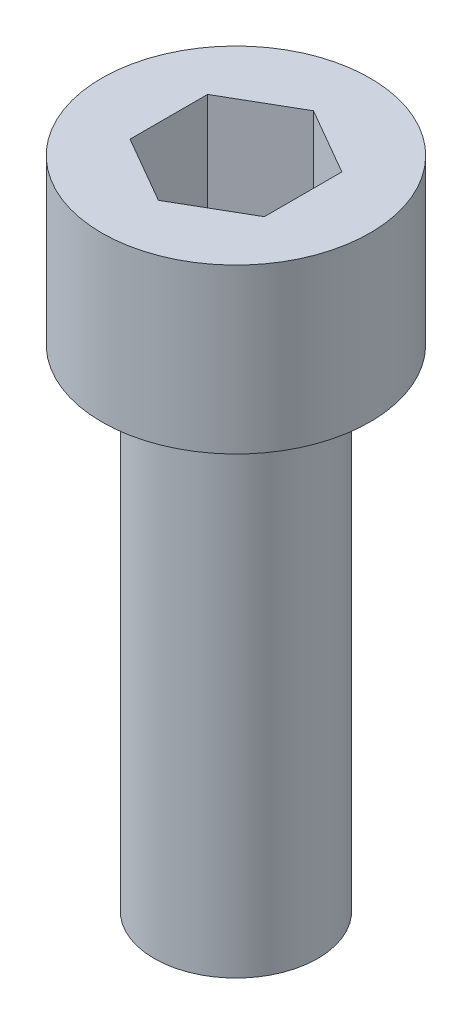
from build123d import *

# Parameters (mm, degrees)
CUT_EXTRUDE1_DEPTH = 3.048


with BuildPart() as part:
    # Sketch1 → Revolve1 (revolve)
    with BuildSketch(Plane.XY, mode=Mode.PRIVATE) as revolve1_sk:
        Polygon((0, 0), (-2.6035, 0), (-2.6035, -3.175), (-1.5875, -3.175), (-1.5875, -12.7), (0, -12.7), align=None)
    revolve(revolve1_sk.sketch.rotate(Axis((0, 66.04, 0), (0, -1, 0)), 270), axis=Axis((0, 66.04, 0), (0, -1, 0)))

    # Sketch2 → Cut-Extrude1 (cut)
    with BuildSketch(Plane(origin=(0, 0, 0), x_dir=(-1, 0, 0), z_dir=(0, 1, 0))):
        Polygon((0, -1.504450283), (1.302892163, -0.752225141), (1.302892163, 0.752225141), (0, 1.504450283), (-1.302892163, 0.752225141), (-1.302892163, -0.752225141), align=None)
    extrude(amount=-CUT_EXTRUDE1_DEPTH, mode=Mode.SUBTRACT)


solid = part.part
